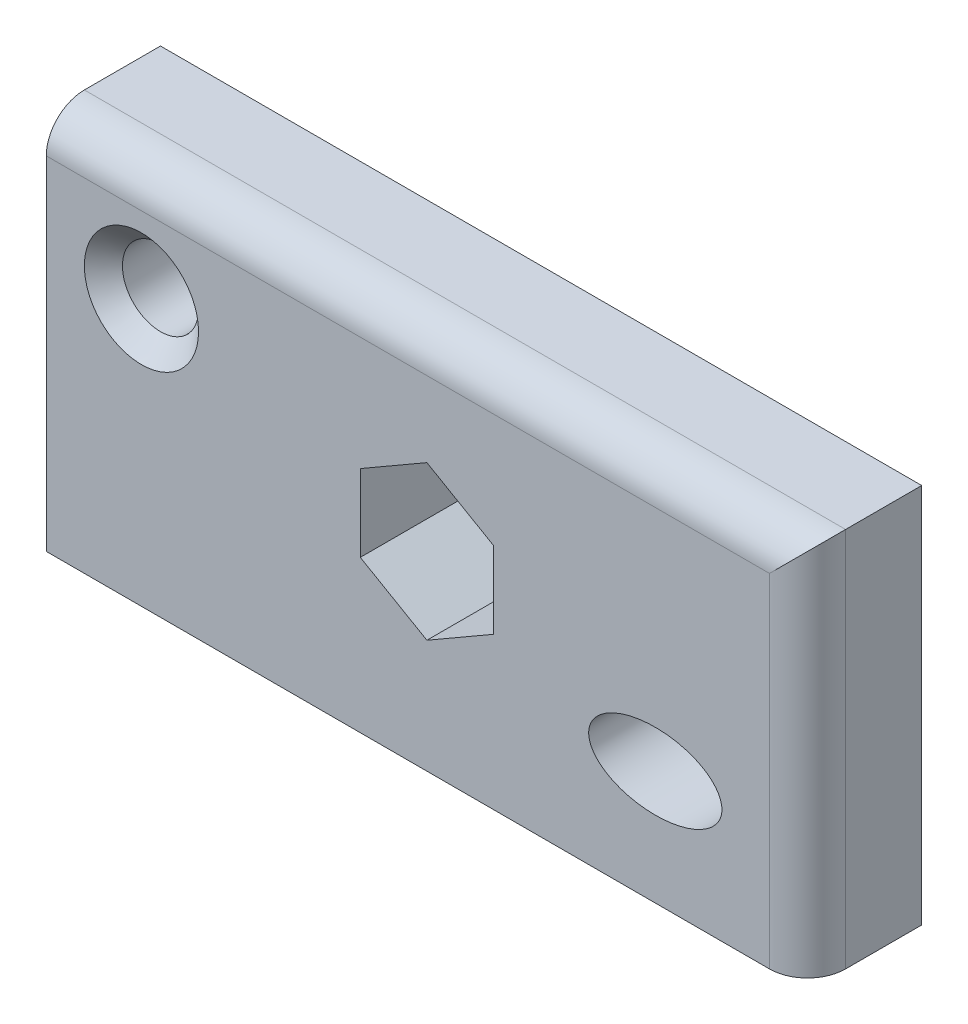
ISO-10303-21;
HEADER;
FILE_DESCRIPTION(('STEP AP214'),'2;1');
FILE_NAME('part.step','',(''),(''),'','','');
FILE_SCHEMA(('AUTOMOTIVE_DESIGN { 1 0 10303 214 1 1 1 1 }'));
ENDSEC;
DATA;
#1=APPLICATION_CONTEXT('core data for automotive mechanical design processes');
#2=APPLICATION_PROTOCOL_DEFINITION('international standard','automotive_design',2000,#1);
#3=PRODUCT_CONTEXT('',#1,'mechanical');
#4=PRODUCT('Part','Part','',(#3));
#5=PRODUCT_RELATED_PRODUCT_CATEGORY('part','',(#4));
#6=PRODUCT_DEFINITION_FORMATION('','',#4);
#7=PRODUCT_DEFINITION_CONTEXT('part definition',#1,'design');
#8=PRODUCT_DEFINITION('design','',#6,#7);
#9=PRODUCT_DEFINITION_SHAPE('','',#8);
#10=(LENGTH_UNIT() NAMED_UNIT(*) SI_UNIT(.MILLI.,.METRE.));
#11=(NAMED_UNIT(*) PLANE_ANGLE_UNIT() SI_UNIT($,.RADIAN.));
#12=(NAMED_UNIT(*) SI_UNIT($,.STERADIAN.) SOLID_ANGLE_UNIT());
#13=UNCERTAINTY_MEASURE_WITH_UNIT(LENGTH_MEASURE(1.E-05),#10,'distance_accuracy_value','');
#14=(GEOMETRIC_REPRESENTATION_CONTEXT(3) GLOBAL_UNCERTAINTY_ASSIGNED_CONTEXT((#13)) GLOBAL_UNIT_ASSIGNED_CONTEXT((#10,
#11,#12)) REPRESENTATION_CONTEXT('',''));
#15=CARTESIAN_POINT('',(0.,0.,0.));
#16=DIRECTION('',(0.,0.,1.));
#17=DIRECTION('',(1.,0.,0.));
#18=AXIS2_PLACEMENT_3D('',#15,#16,#17);
#19=CARTESIAN_POINT('',(-100.,-50.,30.));
#20=DIRECTION('',(1.,0.,0.));
#21=DIRECTION('',(0.,0.,-1.));
#22=AXIS2_PLACEMENT_3D('',#19,#20,#21);
#23=PLANE('',#22);
#24=DIRECTION('',(0.,-1.,0.));
#25=VECTOR('',#24,1.);
#26=CARTESIAN_POINT('',(-100.,-50.,30.));
#27=LINE('',#26,#25);
#28=CARTESIAN_POINT('',(-100.,40.,30.));
#29=VERTEX_POINT('',#28);
#30=CARTESIAN_POINT('',(-100.,-50.,30.));
#31=VERTEX_POINT('',#30);
#32=EDGE_CURVE('E188',#29,#31,#27,.T.);
#33=ORIENTED_EDGE('',*,*,#32,.F.);
#34=CARTESIAN_POINT('',(-100.,40.,20.));
#35=DIRECTION('',(1.,0.,0.));
#36=DIRECTION('',(0.,0.,-1.));
#37=AXIS2_PLACEMENT_3D('',#34,#35,#36);
#38=CIRCLE('',#37,10.);
#39=CARTESIAN_POINT('',(-100.,50.,20.));
#40=VERTEX_POINT('',#39);
#41=EDGE_CURVE('E48',#29,#40,#38,.F.);
#42=ORIENTED_EDGE('',*,*,#41,.T.);
#43=DIRECTION('',(0.,0.,-1.));
#44=VECTOR('',#43,1.);
#45=CARTESIAN_POINT('',(-100.,50.,30.));
#46=LINE('',#45,#44);
#47=CARTESIAN_POINT('',(-100.,50.,0.));
#48=VERTEX_POINT('',#47);
#49=EDGE_CURVE('E194',#40,#48,#46,.T.);
#50=ORIENTED_EDGE('',*,*,#49,.T.);
#51=DIRECTION('',(0.,-1.,0.));
#52=VECTOR('',#51,1.);
#53=CARTESIAN_POINT('',(-100.,-50.,0.));
#54=LINE('',#53,#52);
#55=CARTESIAN_POINT('',(-100.,-50.,0.));
#56=VERTEX_POINT('',#55);
#57=EDGE_CURVE('E187',#48,#56,#54,.T.);
#58=ORIENTED_EDGE('',*,*,#57,.T.);
#59=DIRECTION('',(0.,0.,-1.));
#60=VECTOR('',#59,1.);
#61=CARTESIAN_POINT('',(-100.,-50.,30.));
#62=LINE('',#61,#60);
#63=EDGE_CURVE('E210',#31,#56,#62,.T.);
#64=ORIENTED_EDGE('',*,*,#63,.F.);
#65=EDGE_LOOP('',(#33,#42,#50,#58,#64));
#66=FACE_BOUND('',#65,.T.);
#67=ADVANCED_FACE('F33',(#66),#23,.F.);
#68=CARTESIAN_POINT('',(100.,-50.,30.));
#69=DIRECTION('',(0.,1.,0.));
#70=DIRECTION('',(-1.,0.,0.));
#71=AXIS2_PLACEMENT_3D('',#68,#69,#70);
#72=PLANE('',#71);
#73=DIRECTION('',(0.,0.,-1.));
#74=VECTOR('',#73,1.);
#75=CARTESIAN_POINT('',(100.,-50.,30.));
#76=LINE('',#75,#74);
#77=CARTESIAN_POINT('',(100.,-50.,20.));
#78=VERTEX_POINT('',#77);
#79=CARTESIAN_POINT('',(100.,-50.,0.));
#80=VERTEX_POINT('',#79);
#81=EDGE_CURVE('E208',#78,#80,#76,.T.);
#82=ORIENTED_EDGE('',*,*,#81,.F.);
#83=CARTESIAN_POINT('',(90.,-50.,20.));
#84=DIRECTION('',(0.,1.,0.));
#85=DIRECTION('',(-1.,0.,0.));
#86=AXIS2_PLACEMENT_3D('',#83,#84,#85);
#87=CIRCLE('',#86,10.);
#88=CARTESIAN_POINT('',(90.,-50.,30.));
#89=VERTEX_POINT('',#88);
#90=EDGE_CURVE('E219',#78,#89,#87,.F.);
#91=ORIENTED_EDGE('',*,*,#90,.T.);
#92=DIRECTION('',(1.,0.,0.));
#93=VECTOR('',#92,1.);
#94=CARTESIAN_POINT('',(100.,-50.,30.));
#95=LINE('',#94,#93);
#96=EDGE_CURVE('E190',#31,#89,#95,.T.);
#97=ORIENTED_EDGE('',*,*,#96,.F.);
#98=ORIENTED_EDGE('',*,*,#63,.T.);
#99=DIRECTION('',(1.,0.,0.));
#100=VECTOR('',#99,1.);
#101=CARTESIAN_POINT('',(100.,-50.,0.));
#102=LINE('',#101,#100);
#103=EDGE_CURVE('E197',#56,#80,#102,.T.);
#104=ORIENTED_EDGE('',*,*,#103,.T.);
#105=EDGE_LOOP('',(#82,#91,#97,#98,#104));
#106=FACE_BOUND('',#105,.T.);
#107=ADVANCED_FACE('F242',(#106),#72,.F.);
#108=CARTESIAN_POINT('',(100.,-50.,30.));
#109=DIRECTION('',(-1.,0.,0.));
#110=DIRECTION('',(0.,0.,1.));
#111=AXIS2_PLACEMENT_3D('',#108,#109,#110);
#112=PLANE('',#111);
#113=DIRECTION('',(0.,0.,-1.));
#114=VECTOR('',#113,1.);
#115=CARTESIAN_POINT('',(100.,50.,30.));
#116=LINE('',#115,#114);
#117=CARTESIAN_POINT('',(100.,50.,20.));
#118=VERTEX_POINT('',#117);
#119=CARTESIAN_POINT('',(100.,50.,0.));
#120=VERTEX_POINT('',#119);
#121=EDGE_CURVE('E206',#118,#120,#116,.T.);
#122=ORIENTED_EDGE('',*,*,#121,.F.);
#123=DIRECTION('',(0.,1.,0.));
#124=VECTOR('',#123,1.);
#125=CARTESIAN_POINT('',(100.,-50.,20.));
#126=LINE('',#125,#124);
#127=EDGE_CURVE('E56',#118,#78,#126,.F.);
#128=ORIENTED_EDGE('',*,*,#127,.T.);
#129=ORIENTED_EDGE('',*,*,#81,.T.);
#130=DIRECTION('',(0.,1.,0.));
#131=VECTOR('',#130,1.);
#132=CARTESIAN_POINT('',(100.,-50.,0.));
#133=LINE('',#132,#131);
#134=EDGE_CURVE('E200',#80,#120,#133,.T.);
#135=ORIENTED_EDGE('',*,*,#134,.T.);
#136=EDGE_LOOP('',(#122,#128,#129,#135));
#137=FACE_BOUND('',#136,.T.);
#138=ADVANCED_FACE('F247',(#137),#112,.F.);
#139=CARTESIAN_POINT('',(100.,50.,30.));
#140=DIRECTION('',(0.,-1.,0.));
#141=DIRECTION('',(1.,0.,0.));
#142=AXIS2_PLACEMENT_3D('',#139,#140,#141);
#143=PLANE('',#142);
#144=ORIENTED_EDGE('',*,*,#49,.F.);
#145=DIRECTION('',(-1.,0.,0.));
#146=VECTOR('',#145,1.);
#147=CARTESIAN_POINT('',(100.,50.,20.));
#148=LINE('',#147,#146);
#149=EDGE_CURVE('E222',#40,#118,#148,.F.);
#150=ORIENTED_EDGE('',*,*,#149,.T.);
#151=ORIENTED_EDGE('',*,*,#121,.T.);
#152=DIRECTION('',(-1.,0.,0.));
#153=VECTOR('',#152,1.);
#154=CARTESIAN_POINT('',(100.,50.,0.));
#155=LINE('',#154,#153);
#156=EDGE_CURVE('E191',#120,#48,#155,.T.);
#157=ORIENTED_EDGE('',*,*,#156,.T.);
#158=EDGE_LOOP('',(#144,#150,#151,#157));
#159=FACE_BOUND('',#158,.T.);
#160=ADVANCED_FACE('F263',(#159),#143,.F.);
#161=CARTESIAN_POINT('',(0.,0.,30.));
#162=DIRECTION('',(0.,0.,1.));
#163=DIRECTION('',(1.,0.,0.));
#164=AXIS2_PLACEMENT_3D('',#161,#162,#163);
#165=PLANE('',#164);
#166=CARTESIAN_POINT('',(-75.,20.,30.));
#167=DIRECTION('',(0.,0.,1.));
#168=DIRECTION('',(1.,0.,0.));
#169=AXIS2_PLACEMENT_3D('',#166,#167,#168);
#170=CIRCLE('',#169,15.0000000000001);
#171=CARTESIAN_POINT('',(-60.,20.,30.));
#172=VERTEX_POINT('',#171);
#173=EDGE_CURVE('E11',#172,#172,#170,.F.);
#174=ORIENTED_EDGE('',*,*,#173,.T.);
#175=EDGE_LOOP('',(#174));
#176=FACE_BOUND('',#175,.T.);
#177=CARTESIAN_POINT('',(60.,-20.,30.));
#178=DIRECTION('',(0.,0.,1.));
#179=DIRECTION('',(1.,0.,0.));
#180=AXIS2_PLACEMENT_3D('',#177,#178,#179);
#181=ELLIPSE('',#180,17.5,10.);
#182=CARTESIAN_POINT('',(77.5,-20.,30.));
#183=VERTEX_POINT('',#182);
#184=EDGE_CURVE('E153',#183,#183,#181,.T.);
#185=ORIENTED_EDGE('',*,*,#184,.F.);
#186=EDGE_LOOP('',(#185));
#187=FACE_BOUND('',#186,.T.);
#188=DIRECTION('',(-0.866025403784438,-0.5,0.));
#189=VECTOR('',#188,1.);
#190=CARTESIAN_POINT('',(0.,20.2072594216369,30.));
#191=LINE('',#190,#189);
#192=CARTESIAN_POINT('',(0.,20.2072594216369,30.));
#193=VERTEX_POINT('',#192);
#194=CARTESIAN_POINT('',(-17.5,10.1036297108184,30.));
#195=VERTEX_POINT('',#194);
#196=EDGE_CURVE('E128',#193,#195,#191,.T.);
#197=ORIENTED_EDGE('',*,*,#196,.F.);
#198=DIRECTION('',(-0.866025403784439,0.5,0.));
#199=VECTOR('',#198,1.);
#200=CARTESIAN_POINT('',(17.5,10.1036297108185,30.));
#201=LINE('',#200,#199);
#202=CARTESIAN_POINT('',(17.5,10.1036297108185,30.));
#203=VERTEX_POINT('',#202);
#204=EDGE_CURVE('E147',#203,#193,#201,.T.);
#205=ORIENTED_EDGE('',*,*,#204,.F.);
#206=DIRECTION('',(0.,1.,0.));
#207=VECTOR('',#206,1.);
#208=CARTESIAN_POINT('',(17.5,-10.1036297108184,30.));
#209=LINE('',#208,#207);
#210=CARTESIAN_POINT('',(17.5,-10.1036297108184,30.));
#211=VERTEX_POINT('',#210);
#212=EDGE_CURVE('E150',#211,#203,#209,.T.);
#213=ORIENTED_EDGE('',*,*,#212,.F.);
#214=DIRECTION('',(0.866025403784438,0.5,0.));
#215=VECTOR('',#214,1.);
#216=CARTESIAN_POINT('',(0.,-20.2072594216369,30.));
#217=LINE('',#216,#215);
#218=CARTESIAN_POINT('',(0.,-20.2072594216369,30.));
#219=VERTEX_POINT('',#218);
#220=EDGE_CURVE('E170',#219,#211,#217,.T.);
#221=ORIENTED_EDGE('',*,*,#220,.F.);
#222=DIRECTION('',(0.866025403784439,-0.5,0.));
#223=VECTOR('',#222,1.);
#224=CARTESIAN_POINT('',(-17.5,-10.1036297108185,30.));
#225=LINE('',#224,#223);
#226=CARTESIAN_POINT('',(-17.5,-10.1036297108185,30.));
#227=VERTEX_POINT('',#226);
#228=EDGE_CURVE('E167',#227,#219,#225,.T.);
#229=ORIENTED_EDGE('',*,*,#228,.F.);
#230=DIRECTION('',(0.,-1.,0.));
#231=VECTOR('',#230,1.);
#232=CARTESIAN_POINT('',(-17.5,10.1036297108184,30.));
#233=LINE('',#232,#231);
#234=EDGE_CURVE('E164',#195,#227,#233,.T.);
#235=ORIENTED_EDGE('',*,*,#234,.F.);
#236=EDGE_LOOP('',(#197,#205,#213,#221,#229,#235));
#237=FACE_BOUND('',#236,.T.);
#238=ORIENTED_EDGE('',*,*,#96,.T.);
#239=DIRECTION('',(0.,1.,0.));
#240=VECTOR('',#239,1.);
#241=CARTESIAN_POINT('',(90.,50.,30.));
#242=LINE('',#241,#240);
#243=CARTESIAN_POINT('',(90.,40.,30.));
#244=VERTEX_POINT('',#243);
#245=EDGE_CURVE('E215',#89,#244,#242,.T.);
#246=ORIENTED_EDGE('',*,*,#245,.T.);
#247=DIRECTION('',(-1.,0.,0.));
#248=VECTOR('',#247,1.);
#249=CARTESIAN_POINT('',(-100.,40.,30.));
#250=LINE('',#249,#248);
#251=EDGE_CURVE('E213',#244,#29,#250,.T.);
#252=ORIENTED_EDGE('',*,*,#251,.T.);
#253=ORIENTED_EDGE('',*,*,#32,.T.);
#254=EDGE_LOOP('',(#238,#246,#252,#253));
#255=FACE_BOUND('',#254,.T.);
#256=ADVANCED_FACE('F271',(#176,#187,#237,#255),#165,.T.);
#257=CARTESIAN_POINT('',(0.,0.,0.));
#258=DIRECTION('',(0.,0.,1.));
#259=DIRECTION('',(1.,0.,0.));
#260=AXIS2_PLACEMENT_3D('',#257,#258,#259);
#261=PLANE('',#260);
#262=CARTESIAN_POINT('',(60.,-20.,0.));
#263=DIRECTION('',(0.,0.,1.));
#264=DIRECTION('',(1.,0.,0.));
#265=AXIS2_PLACEMENT_3D('',#262,#263,#264);
#266=ELLIPSE('',#265,17.5,10.);
#267=CARTESIAN_POINT('',(77.5,-20.,0.));
#268=VERTEX_POINT('',#267);
#269=EDGE_CURVE('E165',#268,#268,#266,.T.);
#270=ORIENTED_EDGE('',*,*,#269,.T.);
#271=EDGE_LOOP('',(#270));
#272=FACE_BOUND('',#271,.T.);
#273=DIRECTION('',(-0.866025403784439,0.5,0.));
#274=VECTOR('',#273,1.);
#275=CARTESIAN_POINT('',(17.5,10.1036297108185,0.));
#276=LINE('',#275,#274);
#277=CARTESIAN_POINT('',(17.5,10.1036297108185,0.));
#278=VERTEX_POINT('',#277);
#279=CARTESIAN_POINT('',(0.,20.2072594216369,0.));
#280=VERTEX_POINT('',#279);
#281=EDGE_CURVE('E133',#278,#280,#276,.T.);
#282=ORIENTED_EDGE('',*,*,#281,.T.);
#283=DIRECTION('',(-0.866025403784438,-0.5,0.));
#284=VECTOR('',#283,1.);
#285=CARTESIAN_POINT('',(0.,20.2072594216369,0.));
#286=LINE('',#285,#284);
#287=CARTESIAN_POINT('',(-17.5,10.1036297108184,0.));
#288=VERTEX_POINT('',#287);
#289=EDGE_CURVE('E125',#280,#288,#286,.T.);
#290=ORIENTED_EDGE('',*,*,#289,.T.);
#291=DIRECTION('',(0.,-1.,0.));
#292=VECTOR('',#291,1.);
#293=CARTESIAN_POINT('',(-17.5,10.1036297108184,0.));
#294=LINE('',#293,#292);
#295=CARTESIAN_POINT('',(-17.5,-10.1036297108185,0.));
#296=VERTEX_POINT('',#295);
#297=EDGE_CURVE('E137',#288,#296,#294,.T.);
#298=ORIENTED_EDGE('',*,*,#297,.T.);
#299=DIRECTION('',(0.866025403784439,-0.5,0.));
#300=VECTOR('',#299,1.);
#301=CARTESIAN_POINT('',(-17.5,-10.1036297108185,0.));
#302=LINE('',#301,#300);
#303=CARTESIAN_POINT('',(0.,-20.2072594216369,0.));
#304=VERTEX_POINT('',#303);
#305=EDGE_CURVE('E141',#296,#304,#302,.T.);
#306=ORIENTED_EDGE('',*,*,#305,.T.);
#307=DIRECTION('',(0.866025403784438,0.5,0.));
#308=VECTOR('',#307,1.);
#309=CARTESIAN_POINT('',(0.,-20.2072594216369,0.));
#310=LINE('',#309,#308);
#311=CARTESIAN_POINT('',(17.5,-10.1036297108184,0.));
#312=VERTEX_POINT('',#311);
#313=EDGE_CURVE('E157',#304,#312,#310,.T.);
#314=ORIENTED_EDGE('',*,*,#313,.T.);
#315=DIRECTION('',(0.,1.,0.));
#316=VECTOR('',#315,1.);
#317=CARTESIAN_POINT('',(17.5,-10.1036297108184,0.));
#318=LINE('',#317,#316);
#319=EDGE_CURVE('E160',#312,#278,#318,.T.);
#320=ORIENTED_EDGE('',*,*,#319,.T.);
#321=EDGE_LOOP('',(#282,#290,#298,#306,#314,#320));
#322=FACE_BOUND('',#321,.T.);
#323=CARTESIAN_POINT('',(-75.,20.,0.));
#324=DIRECTION('',(0.,0.,1.));
#325=DIRECTION('',(1.,0.,0.));
#326=AXIS2_PLACEMENT_3D('',#323,#324,#325);
#327=CIRCLE('',#326,9.99999999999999);
#328=CARTESIAN_POINT('',(-65.,20.,0.));
#329=VERTEX_POINT('',#328);
#330=EDGE_CURVE('E177',#329,#329,#327,.T.);
#331=ORIENTED_EDGE('',*,*,#330,.T.);
#332=EDGE_LOOP('',(#331));
#333=FACE_BOUND('',#332,.T.);
#334=ORIENTED_EDGE('',*,*,#57,.F.);
#335=ORIENTED_EDGE('',*,*,#156,.F.);
#336=ORIENTED_EDGE('',*,*,#134,.F.);
#337=ORIENTED_EDGE('',*,*,#103,.F.);
#338=EDGE_LOOP('',(#334,#335,#336,#337));
#339=FACE_BOUND('',#338,.T.);
#340=ADVANCED_FACE('F143',(#272,#322,#333,#339),#261,.F.);
#341=CARTESIAN_POINT('',(-75.,20.,0.));
#342=DIRECTION('',(0.,0.,1.));
#343=DIRECTION('',(1.,0.,0.));
#344=AXIS2_PLACEMENT_3D('',#341,#342,#343);
#345=CYLINDRICAL_SURFACE('',#344,9.99999999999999);
#346=CARTESIAN_POINT('',(-75.,20.,24.9999999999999));
#347=DIRECTION('',(0.,0.,1.));
#348=DIRECTION('',(1.,0.,0.));
#349=AXIS2_PLACEMENT_3D('',#346,#347,#348);
#350=CIRCLE('',#349,9.99999999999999);
#351=CARTESIAN_POINT('',(-65.,20.,24.9999999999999));
#352=VERTEX_POINT('',#351);
#353=EDGE_CURVE('E41',#352,#352,#350,.T.);
#354=ORIENTED_EDGE('',*,*,#353,.T.);
#355=EDGE_LOOP('',(#354));
#356=FACE_BOUND('',#355,.T.);
#357=ORIENTED_EDGE('',*,*,#330,.F.);
#358=EDGE_LOOP('',(#357));
#359=FACE_BOUND('',#358,.T.);
#360=ADVANCED_FACE('F228',(#356,#359),#345,.F.);
#361=CARTESIAN_POINT('',(0.,20.2072594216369,0.));
#362=DIRECTION('',(-0.5,0.866025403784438,0.));
#363=DIRECTION('',(-0.866025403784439,-0.5,0.));
#364=AXIS2_PLACEMENT_3D('',#361,#362,#363);
#365=PLANE('',#364);
#366=ORIENTED_EDGE('',*,*,#196,.T.);
#367=DIRECTION('',(0.,0.,1.));
#368=VECTOR('',#367,1.);
#369=CARTESIAN_POINT('',(-17.5,10.1036297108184,0.));
#370=LINE('',#369,#368);
#371=EDGE_CURVE('E121',#288,#195,#370,.T.);
#372=ORIENTED_EDGE('',*,*,#371,.F.);
#373=ORIENTED_EDGE('',*,*,#289,.F.);
#374=DIRECTION('',(0.,0.,1.));
#375=VECTOR('',#374,1.);
#376=CARTESIAN_POINT('',(0.,20.2072594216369,0.));
#377=LINE('',#376,#375);
#378=EDGE_CURVE('E175',#280,#193,#377,.T.);
#379=ORIENTED_EDGE('',*,*,#378,.T.);
#380=EDGE_LOOP('',(#366,#372,#373,#379));
#381=FACE_BOUND('',#380,.T.);
#382=ADVANCED_FACE('F123',(#381),#365,.F.);
#383=CARTESIAN_POINT('',(17.5,10.1036297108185,0.));
#384=DIRECTION('',(0.5,0.866025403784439,0.));
#385=DIRECTION('',(-0.866025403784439,0.5,0.));
#386=AXIS2_PLACEMENT_3D('',#383,#384,#385);
#387=PLANE('',#386);
#388=ORIENTED_EDGE('',*,*,#204,.T.);
#389=ORIENTED_EDGE('',*,*,#378,.F.);
#390=ORIENTED_EDGE('',*,*,#281,.F.);
#391=DIRECTION('',(0.,0.,1.));
#392=VECTOR('',#391,1.);
#393=CARTESIAN_POINT('',(17.5,10.1036297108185,0.));
#394=LINE('',#393,#392);
#395=EDGE_CURVE('E178',#278,#203,#394,.T.);
#396=ORIENTED_EDGE('',*,*,#395,.T.);
#397=EDGE_LOOP('',(#388,#389,#390,#396));
#398=FACE_BOUND('',#397,.T.);
#399=ADVANCED_FACE('F363',(#398),#387,.F.);
#400=CARTESIAN_POINT('',(17.5,-10.1036297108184,0.));
#401=DIRECTION('',(1.,0.,0.));
#402=DIRECTION('',(0.,0.,-1.));
#403=AXIS2_PLACEMENT_3D('',#400,#401,#402);
#404=PLANE('',#403);
#405=ORIENTED_EDGE('',*,*,#212,.T.);
#406=ORIENTED_EDGE('',*,*,#395,.F.);
#407=ORIENTED_EDGE('',*,*,#319,.F.);
#408=DIRECTION('',(0.,0.,1.));
#409=VECTOR('',#408,1.);
#410=CARTESIAN_POINT('',(17.5,-10.1036297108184,0.));
#411=LINE('',#410,#409);
#412=EDGE_CURVE('E180',#312,#211,#411,.T.);
#413=ORIENTED_EDGE('',*,*,#412,.T.);
#414=EDGE_LOOP('',(#405,#406,#407,#413));
#415=FACE_BOUND('',#414,.T.);
#416=ADVANCED_FACE('F354',(#415),#404,.F.);
#417=CARTESIAN_POINT('',(0.,-20.2072594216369,0.));
#418=DIRECTION('',(0.5,-0.866025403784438,0.));
#419=DIRECTION('',(0.866025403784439,0.5,0.));
#420=AXIS2_PLACEMENT_3D('',#417,#418,#419);
#421=PLANE('',#420);
#422=ORIENTED_EDGE('',*,*,#220,.T.);
#423=ORIENTED_EDGE('',*,*,#412,.F.);
#424=ORIENTED_EDGE('',*,*,#313,.F.);
#425=DIRECTION('',(0.,0.,1.));
#426=VECTOR('',#425,1.);
#427=CARTESIAN_POINT('',(0.,-20.2072594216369,0.));
#428=LINE('',#427,#426);
#429=EDGE_CURVE('E182',#304,#219,#428,.T.);
#430=ORIENTED_EDGE('',*,*,#429,.T.);
#431=EDGE_LOOP('',(#422,#423,#424,#430));
#432=FACE_BOUND('',#431,.T.);
#433=ADVANCED_FACE('F345',(#432),#421,.F.);
#434=CARTESIAN_POINT('',(-17.5,-10.1036297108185,0.));
#435=DIRECTION('',(-0.5,-0.866025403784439,0.));
#436=DIRECTION('',(0.866025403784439,-0.5,0.));
#437=AXIS2_PLACEMENT_3D('',#434,#435,#436);
#438=PLANE('',#437);
#439=ORIENTED_EDGE('',*,*,#228,.T.);
#440=ORIENTED_EDGE('',*,*,#429,.F.);
#441=ORIENTED_EDGE('',*,*,#305,.F.);
#442=DIRECTION('',(0.,0.,1.));
#443=VECTOR('',#442,1.);
#444=CARTESIAN_POINT('',(-17.5,-10.1036297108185,0.));
#445=LINE('',#444,#443);
#446=EDGE_CURVE('E132',#296,#227,#445,.T.);
#447=ORIENTED_EDGE('',*,*,#446,.T.);
#448=EDGE_LOOP('',(#439,#440,#441,#447));
#449=FACE_BOUND('',#448,.T.);
#450=ADVANCED_FACE('F337',(#449),#438,.F.);
#451=CARTESIAN_POINT('',(-17.5,10.1036297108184,0.));
#452=DIRECTION('',(-1.,0.,0.));
#453=DIRECTION('',(0.,0.,1.));
#454=AXIS2_PLACEMENT_3D('',#451,#452,#453);
#455=PLANE('',#454);
#456=ORIENTED_EDGE('',*,*,#234,.T.);
#457=ORIENTED_EDGE('',*,*,#446,.F.);
#458=ORIENTED_EDGE('',*,*,#297,.F.);
#459=ORIENTED_EDGE('',*,*,#371,.T.);
#460=EDGE_LOOP('',(#456,#457,#458,#459));
#461=FACE_BOUND('',#460,.T.);
#462=ADVANCED_FACE('F138',(#461),#455,.F.);
#463=DIRECTION('',(0.,0.,1.));
#464=VECTOR('',#463,1.);
#465=SURFACE_OF_LINEAR_EXTRUSION('',#266,#464);
#466=ORIENTED_EDGE('',*,*,#269,.F.);
#467=EDGE_LOOP('',(#466));
#468=FACE_BOUND('',#467,.T.);
#469=ORIENTED_EDGE('',*,*,#184,.T.);
#470=EDGE_LOOP('',(#469));
#471=FACE_BOUND('',#470,.T.);
#472=ADVANCED_FACE('F252',(#468,#471),#465,.F.);
#473=CARTESIAN_POINT('',(0.,40.,20.));
#474=DIRECTION('',(1.,0.,0.));
#475=DIRECTION('',(0.,1.,0.));
#476=AXIS2_PLACEMENT_3D('',#473,#474,#475);
#477=CYLINDRICAL_SURFACE('',#476,10.);
#478=ORIENTED_EDGE('',*,*,#41,.F.);
#479=ORIENTED_EDGE('',*,*,#251,.F.);
#480=CARTESIAN_POINT('',(90.,40.,20.));
#481=DIRECTION('',(0.707106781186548,-0.707106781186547,0.));
#482=DIRECTION('',(0.707106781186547,0.707106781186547,0.));
#483=AXIS2_PLACEMENT_3D('',#480,#481,#482);
#484=ELLIPSE('',#483,14.142135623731,10.);
#485=EDGE_CURVE('E224',#118,#244,#484,.T.);
#486=ORIENTED_EDGE('',*,*,#485,.F.);
#487=ORIENTED_EDGE('',*,*,#149,.F.);
#488=EDGE_LOOP('',(#478,#479,#486,#487));
#489=FACE_BOUND('',#488,.T.);
#490=ADVANCED_FACE('F237',(#489),#477,.T.);
#491=CARTESIAN_POINT('',(90.,0.,20.));
#492=DIRECTION('',(0.,-1.,0.));
#493=DIRECTION('',(0.,0.,-1.));
#494=AXIS2_PLACEMENT_3D('',#491,#492,#493);
#495=CYLINDRICAL_SURFACE('',#494,10.);
#496=ORIENTED_EDGE('',*,*,#90,.F.);
#497=ORIENTED_EDGE('',*,*,#127,.F.);
#498=ORIENTED_EDGE('',*,*,#485,.T.);
#499=ORIENTED_EDGE('',*,*,#245,.F.);
#500=EDGE_LOOP('',(#496,#497,#498,#499));
#501=FACE_BOUND('',#500,.T.);
#502=ADVANCED_FACE('F232',(#501),#495,.T.);
#503=CARTESIAN_POINT('',(-75.,20.,24.9999999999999));
#504=DIRECTION('',(0.,0.,1.));
#505=DIRECTION('',(1.,0.,0.));
#506=AXIS2_PLACEMENT_3D('',#503,#504,#505);
#507=CONICAL_SURFACE('',#506,9.99999999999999,0.78539816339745);
#508=CARTESIAN_POINT('',(-60.,20.,30.));
#509=CARTESIAN_POINT('',(-60.0520833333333,20.,29.9479166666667));
#510=CARTESIAN_POINT('',(-60.1041666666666,20.,29.8958333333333));
#511=CARTESIAN_POINT('',(-60.2083333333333,20.,29.7916666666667));
#512=CARTESIAN_POINT('',(-60.2604166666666,20.,29.7395833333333));
#513=CARTESIAN_POINT('',(-60.3645833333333,20.,29.6354166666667));
#514=CARTESIAN_POINT('',(-60.4166666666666,20.,29.5833333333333));
#515=CARTESIAN_POINT('',(-60.5208333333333,20.,29.4791666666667));
#516=CARTESIAN_POINT('',(-60.5729166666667,20.,29.4270833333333));
#517=CARTESIAN_POINT('',(-60.6770833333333,20.,29.3229166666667));
#518=CARTESIAN_POINT('',(-60.7291666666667,20.,29.2708333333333));
#519=CARTESIAN_POINT('',(-60.8333333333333,20.,29.1666666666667));
#520=CARTESIAN_POINT('',(-60.8854166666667,20.,29.1145833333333));
#521=CARTESIAN_POINT('',(-60.9895833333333,20.,29.0104166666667));
#522=CARTESIAN_POINT('',(-61.0416666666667,20.,28.9583333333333));
#523=CARTESIAN_POINT('',(-61.1458333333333,20.,28.8541666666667));
#524=CARTESIAN_POINT('',(-61.1979166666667,20.,28.8020833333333));
#525=CARTESIAN_POINT('',(-61.3020833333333,20.,28.6979166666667));
#526=CARTESIAN_POINT('',(-61.3541666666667,20.,28.6458333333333));
#527=CARTESIAN_POINT('',(-61.4583333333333,20.,28.5416666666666));
#528=CARTESIAN_POINT('',(-61.5104166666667,20.,28.4895833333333));
#529=CARTESIAN_POINT('',(-61.6145833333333,20.,28.3854166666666));
#530=CARTESIAN_POINT('',(-61.6666666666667,20.,28.3333333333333));
#531=CARTESIAN_POINT('',(-61.7708333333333,20.,28.2291666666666));
#532=CARTESIAN_POINT('',(-61.8229166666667,20.,28.1770833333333));
#533=CARTESIAN_POINT('',(-61.9270833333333,20.,28.0729166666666));
#534=CARTESIAN_POINT('',(-61.9791666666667,20.,28.0208333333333));
#535=CARTESIAN_POINT('',(-62.0833333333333,20.,27.9166666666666));
#536=CARTESIAN_POINT('',(-62.1354166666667,20.,27.8645833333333));
#537=CARTESIAN_POINT('',(-62.2395833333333,20.,27.7604166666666));
#538=CARTESIAN_POINT('',(-62.2916666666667,20.,27.7083333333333));
#539=CARTESIAN_POINT('',(-62.3958333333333,20.,27.6041666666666));
#540=CARTESIAN_POINT('',(-62.4479166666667,20.,27.5520833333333));
#541=CARTESIAN_POINT('',(-62.5520833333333,20.,27.4479166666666));
#542=CARTESIAN_POINT('',(-62.6041666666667,20.,27.3958333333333));
#543=CARTESIAN_POINT('',(-62.7083333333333,20.,27.2916666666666));
#544=CARTESIAN_POINT('',(-62.7604166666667,20.,27.2395833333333));
#545=CARTESIAN_POINT('',(-62.8645833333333,20.,27.1354166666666));
#546=CARTESIAN_POINT('',(-62.9166666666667,20.,27.0833333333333));
#547=CARTESIAN_POINT('',(-63.0208333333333,20.,26.9791666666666));
#548=CARTESIAN_POINT('',(-63.0729166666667,20.,26.9270833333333));
#549=CARTESIAN_POINT('',(-63.1770833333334,20.,26.8229166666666));
#550=CARTESIAN_POINT('',(-63.2291666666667,20.,26.7708333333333));
#551=CARTESIAN_POINT('',(-63.3333333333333,20.,26.6666666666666));
#552=CARTESIAN_POINT('',(-63.3854166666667,20.,26.6145833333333));
#553=CARTESIAN_POINT('',(-63.4895833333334,20.,26.5104166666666));
#554=CARTESIAN_POINT('',(-63.5416666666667,20.,26.4583333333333));
#555=CARTESIAN_POINT('',(-63.6458333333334,20.,26.3541666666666));
#556=CARTESIAN_POINT('',(-63.6979166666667,20.,26.3020833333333));
#557=CARTESIAN_POINT('',(-63.8020833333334,20.,26.1979166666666));
#558=CARTESIAN_POINT('',(-63.8541666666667,20.,26.1458333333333));
#559=CARTESIAN_POINT('',(-63.9583333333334,20.,26.0416666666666));
#560=CARTESIAN_POINT('',(-64.0104166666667,20.,25.9895833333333));
#561=CARTESIAN_POINT('',(-64.1145833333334,20.,25.8854166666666));
#562=CARTESIAN_POINT('',(-64.1666666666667,20.,25.8333333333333));
#563=CARTESIAN_POINT('',(-64.2708333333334,20.,25.7291666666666));
#564=CARTESIAN_POINT('',(-64.3229166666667,20.,25.6770833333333));
#565=CARTESIAN_POINT('',(-64.4270833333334,20.,25.5729166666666));
#566=CARTESIAN_POINT('',(-64.4791666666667,20.,25.5208333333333));
#567=CARTESIAN_POINT('',(-64.5833333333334,20.,25.4166666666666));
#568=CARTESIAN_POINT('',(-64.6354166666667,20.,25.3645833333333));
#569=CARTESIAN_POINT('',(-64.7395833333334,20.,25.2604166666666));
#570=CARTESIAN_POINT('',(-64.7916666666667,20.,25.2083333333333));
#571=CARTESIAN_POINT('',(-64.8958333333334,20.,25.1041666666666));
#572=CARTESIAN_POINT('',(-64.9479166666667,20.,25.0520833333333));
#573=CARTESIAN_POINT('',(-65.,20.,24.9999999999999));
#574=B_SPLINE_CURVE_WITH_KNOTS('',3,(#508,#509,#510,#511,#512,#513,#514,#515,#516,#517,#518,
#519,#520,#521,#522,#523,#524,#525,#526,#527,#528,#529,#530,#531,#532,#533,#534,#535,#536,#537,
#538,#539,#540,#541,#542,#543,#544,#545,#546,#547,#548,#549,#550,#551,#552,#553,#554,#555,#556,
#557,#558,#559,#560,#561,#562,#563,#564,#565,#566,#567,#568,#569,#570,#571,#572,#573),
.UNSPECIFIED.,.F.,.F.,(4,2,2,2,2,2,2,2,2,2,2,2,2,2,2,2,2,2,2,2,2,2,2,2,2,2,2,2,2,2,2,2,4),(0.,
0.220970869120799,0.4419417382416,0.662912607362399,0.883883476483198,1.10485434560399,
1.32582521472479,1.54679608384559,1.76776695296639,1.98873782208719,2.20970869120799,
2.43067956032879,2.65165042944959,2.87262129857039,3.09359216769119,3.31456303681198,
3.53553390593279,3.75650477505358,3.97747564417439,4.19844651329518,4.41941738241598,
4.64038825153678,4.86135912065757,5.08232998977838,5.30330085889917,5.52427172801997,
5.74524259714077,5.96621346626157,6.18718433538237,6.40815520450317,6.62912607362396,
6.85009694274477,7.07106781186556),.UNSPECIFIED.);
#575=EDGE_CURVE('BSEAM35',#172,#352,#574,.T.);
#576=ORIENTED_EDGE('',*,*,#173,.F.);
#577=ORIENTED_EDGE('',*,*,#353,.F.);
#578=ORIENTED_EDGE('',*,*,#575,.T.);
#579=ORIENTED_EDGE('',*,*,#575,.F.);
#580=EDGE_LOOP('',(#576,#578,#577,#579));
#581=FACE_BOUND('',#580,.T.);
#582=ADVANCED_FACE('F35',(#581),#507,.F.);
#583=CLOSED_SHELL('',(#67,#107,#138,#160,#256,#340,#360,#382,#399,#416,#433,#450,#462,#472,#490,
#502,#582));
#584=MANIFOLD_SOLID_BREP('B2',#583);
#585=ADVANCED_BREP_SHAPE_REPRESENTATION('',(#18,#584),#14);
#586=SHAPE_DEFINITION_REPRESENTATION(#9,#585);
ENDSEC;
END-ISO-10303-21;
